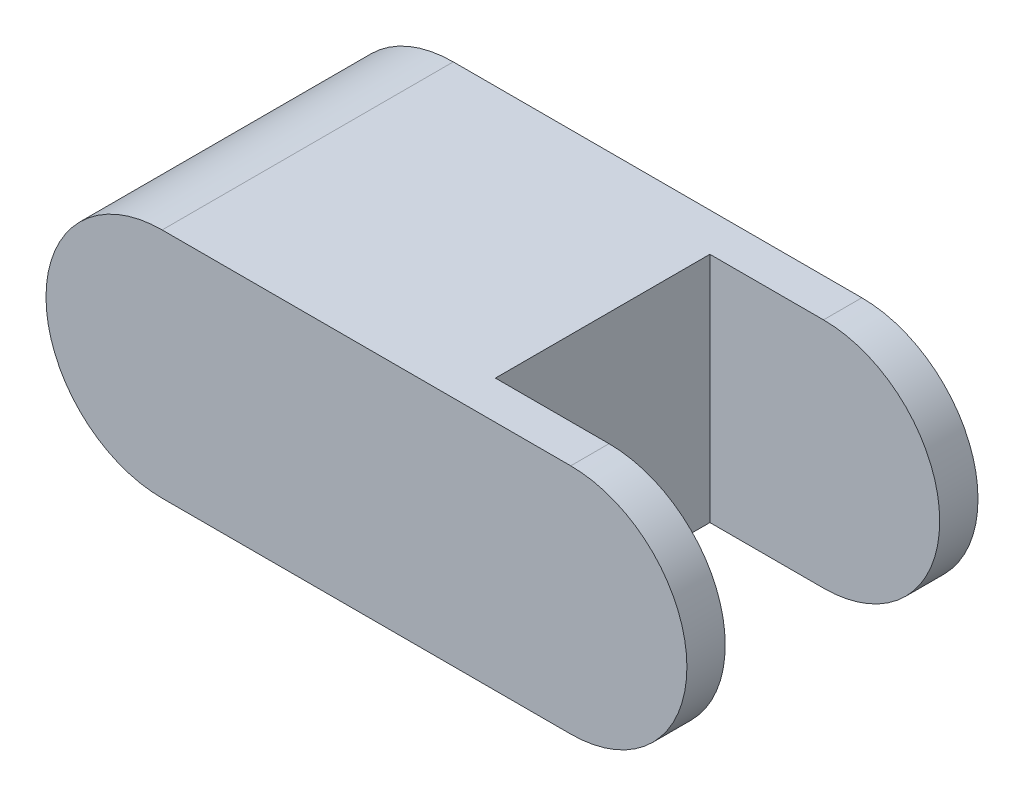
from build123d import *

# Parameters (mm, degrees)
BOSS_EXTRUDE1_DEPTH = 114
SKETCH2_W           = 90
SKETCH2_H           = 84
CUT_EXTRUDE1_DEPTH  = 91


with BuildPart() as part:
    # Sketch1 → Boss-Extrude1 (new body)
    with BuildSketch(Plane.XY):
        with BuildLine():
            Line((0, 45.5), (160, 45.5))
            ThreePointArc((160, 45.5), (205.5, 0), (160, -45.5))
            Line((160, -45.5), (0, -45.5))
            ThreePointArc((0, -45.5), (-45.5, 0), (0, 45.5))
        make_face()
    extrude(amount=-BOSS_EXTRUDE1_DEPTH)

    # Sketch2 → Cut-Extrude1 (cut)
    with BuildSketch(Plane(origin=(0, 45.5, 0), x_dir=(1, 0, 0), z_dir=(0, 1, 0))):
        with Locations((160.5, 57)):
            Rectangle(SKETCH2_W, SKETCH2_H)
    extrude(amount=-CUT_EXTRUDE1_DEPTH, mode=Mode.SUBTRACT)


solid = part.part
